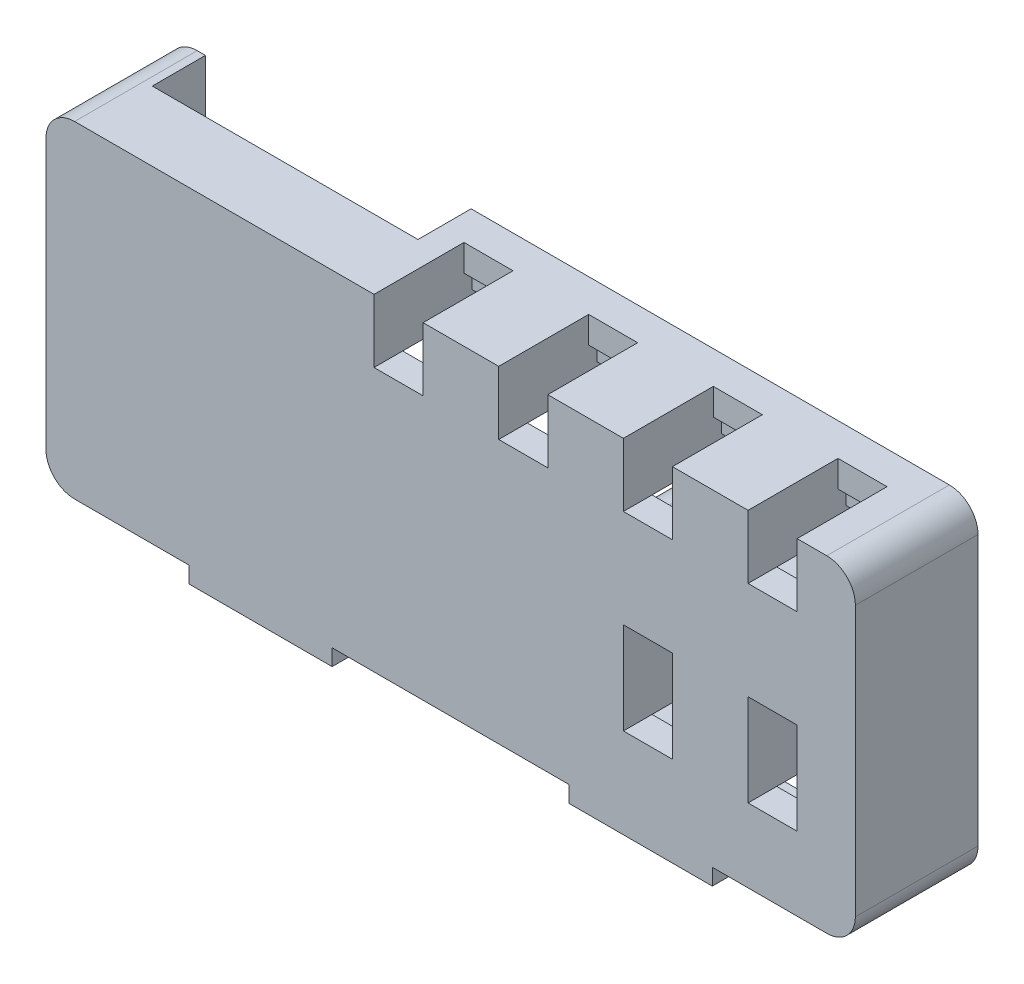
from build123d import *

# Parameters (mm, degrees)
SKETCH1_W           = 39.6
SKETCH1_H           = 16
SKETCH1_W_2         = 36.4
SKETCH1_H_2         = 11.1
BOSS_EXTRUDE1_DEPTH = 4.6
SKETCH2_W           = 12.4
SKETCH2_H           = 3.2
BOSS_EXTRUDE2_DEPTH = 4.6
SKETCH3_W           = 12.4
SKETCH3_H           = 4.2
BOSS_EXTRUDE3_DEPTH = 4.6
SKETCH4_W           = 2.4
SKETCH4_H           = 1.8
CUT_EXTRUDE1_DEPTH  = 4.6
SKETCH5_W           = 8
SKETCH5_H           = 2.4
CUT_EXTRUDE2_DEPTH  = 1.8
SKETCH6_W           = 13
SKETCH6_H           = 2.6
CUT_EXTRUDE3_DEPTH  = 3.1
SKETCH7_W           = 2.4
SKETCH7_H           = 3
CUT_EXTRUDE4_DEPTH  = 3
SKETCH8_W           = 2.4
SKETCH8_H           = 2.7
CUT_EXTRUDE5_DEPTH  = 5
FILLET2_R           = 1.6
BOSS_EXTRUDE5_REACH = 44.338
SKETCH10_W          = 7
SKETCH10_H          = 0.8
SKETCH11_W          = 0.4
SKETCH11_H          = 1.9
BOSS_EXTRUDE6_DEPTH = 4.6
SKETCH12_W          = 2.8
SKETCH12_H          = 0.8
CUT_EXTRUDE6_DEPTH  = 2.4
SKETCH14_W          = 2.4
SKETCH14_H          = 4.5
BOSS_EXTRUDE7_DEPTH = 1.4
FILLET3_R           = 1.4
SKETCH15_W          = 20.7
SKETCH15_H          = 0.9
SKETCH15_W_2        = 8.5
SKETCH15_H_2        = 3.4
BOSS_EXTRUDE8_DEPTH = 1.2


with BuildPart() as part:
    # Sketch1 → Boss-Extrude1 (new body)
    with BuildSketch(Plane.XY):
        with Locations((-19.963182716, -5.794032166)):
            Rectangle(SKETCH1_W, SKETCH1_H)
        with Locations((-19.963182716, -6.444032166)):
            Rectangle(SKETCH1_W_2, SKETCH1_H_2, mode=Mode.SUBTRACT)
    extrude(amount=BOSS_EXTRUDE1_DEPTH)

    # Sketch2 → Boss-Extrude2 (add)
    with BuildSketch(Plane.XY):
        with Locations((-7.963182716, -8.594032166)):
            Rectangle(SKETCH2_W, SKETCH2_H)
    extrude(amount=BOSS_EXTRUDE2_DEPTH)

    # Sketch3 → Boss-Extrude3 (add)
    with BuildSketch(Plane.XY):
        with Locations((-7.963182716, -4.894032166)):
            Rectangle(SKETCH3_W, SKETCH3_H)
    extrude(amount=BOSS_EXTRUDE3_DEPTH)

    # Sketch4 → Cut-Extrude1 (cut)
    with BuildSketch(Plane.XY):
        with Locations((-22.513182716, 0.005967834)):
            Rectangle(SKETCH4_W, SKETCH4_H)
        with Locations((-16.413182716, 0.005967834)):
            Rectangle(SKETCH4_W, SKETCH4_H)
        with Locations((-10.313182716, 0.005967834)):
            Rectangle(SKETCH4_W, SKETCH4_H)
        with Locations((-4.213182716, 0.005967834)):
            Rectangle(SKETCH4_W, SKETCH4_H)
        with Locations((-10.313182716, -9.294032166)):
            Rectangle(SKETCH4_W, SKETCH4_H)
        with Locations((-4.213182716, -9.294032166)):
            Rectangle(SKETCH4_W, SKETCH4_H)
    extrude(amount=CUT_EXTRUDE1_DEPTH, mode=Mode.SUBTRACT)

    # Sketch5 → Cut-Extrude2 (cut)
    with BuildSketch(Plane(origin=(0, -13.794032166, 0), x_dir=(-1, 0, 0), z_dir=(0, -1, 0))):
        with Locations((5.963182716, -1.2)):
            Rectangle(SKETCH5_W, SKETCH5_H)
    extrude(amount=-CUT_EXTRUDE2_DEPTH, mode=Mode.SUBTRACT)

    # Sketch6 → Cut-Extrude3 (cut)
    with BuildSketch(Plane(origin=(0, 2.205967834, 0), x_dir=(1, 0, 0), z_dir=(0, 1, 0))):
        with Locations((-31.463182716, -1.3)):
            Rectangle(SKETCH6_W, SKETCH6_H)
    extrude(amount=-CUT_EXTRUDE3_DEPTH, mode=Mode.SUBTRACT)

    # Sketch7 → Cut-Extrude4 (cut)
    with BuildSketch(Plane(origin=(0, 2.205967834, 0), x_dir=(1, 0, 0), z_dir=(0, 1, 0))):
        with Locations((-22.513182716, -3.1)):
            Rectangle(SKETCH7_W, SKETCH7_H)
        with Locations((-16.413182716, -3.1)):
            Rectangle(SKETCH7_W, SKETCH7_H)
        with Locations((-10.313182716, -3.1)):
            Rectangle(SKETCH7_W, SKETCH7_H)
        with Locations((-4.213182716, -3.1)):
            Rectangle(SKETCH7_W, SKETCH7_H)
    extrude(amount=-CUT_EXTRUDE4_DEPTH, mode=Mode.SUBTRACT)

    # Sketch8 → Cut-Extrude5 (cut)
    with BuildSketch(Plane.XY):
        with Locations((-10.313182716, -7.044032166)):
            Rectangle(SKETCH8_W, SKETCH8_H)
        with Locations((-4.213182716, -7.044032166)):
            Rectangle(SKETCH8_W, SKETCH8_H)
    extrude(amount=CUT_EXTRUDE5_DEPTH, mode=Mode.SUBTRACT)

    # Fillet2
    fillet2_edges = [part.edges().sort_by_distance(p)[0] for p in [
        (-14.163182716, -2.794032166, 2.3),
    ]]
    fillet(fillet2_edges, radius=FILLET2_R)

    # Boss-Extrude5: up to this face of the body (flat: up to its plane)
    boss_extrude5_end = Plane(part.part.faces().sort_by_distance((-13.736080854, -7.294032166, 4.6))[0])
    # Sketch10 → Boss-Extrude5 (add, up to the picked face)
    with BuildSketch(Plane.XY, mode=Mode.PRIVATE) as boss_extrude5_sk1:
        with Locations((-10.663182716, -14.194032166)):
            Rectangle(SKETCH10_W, SKETCH10_H)
    boss_extrude5_tool1 = split(extrude(boss_extrude5_sk1.sketch, amount=BOSS_EXTRUDE5_REACH, mode=Mode.PRIVATE), bisect_by=boss_extrude5_end, keep=Keep.BOTH, mode=Mode.PRIVATE)
    # Sketch10 → Boss-Extrude5 (add, up to the picked face)
    with BuildSketch(Plane.XY, mode=Mode.PRIVATE) as boss_extrude5_sk2:
        with Locations((-29.263182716, -14.194032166)):
            Rectangle(SKETCH10_W, SKETCH10_H)
    boss_extrude5_tool2 = split(extrude(boss_extrude5_sk2.sketch, amount=BOSS_EXTRUDE5_REACH, mode=Mode.PRIVATE), bisect_by=boss_extrude5_end, keep=Keep.BOTH, mode=Mode.PRIVATE)
    add(boss_extrude5_tool1.solids().sort_by(Axis((-10.663183, -14.194032, 0), (0, 0, 1)))[0])
    add(boss_extrude5_tool2.solids().sort_by(Axis((-29.263183, -14.194032, 0), (0, 0, 1)))[0])

    # Sketch11 → Boss-Extrude6 (add)
    with BuildSketch(Plane.XY):
        with Locations((-1.963182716, -1.844032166)):
            Rectangle(SKETCH11_W, SKETCH11_H)
    extrude(amount=BOSS_EXTRUDE6_DEPTH)

    # Sketch12 → Cut-Extrude6 (cut)
    with BuildSketch(Plane.XY):
        with Locations((-8.563182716, -14.194032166)):
            Rectangle(SKETCH12_W, SKETCH12_H)
    extrude(amount=CUT_EXTRUDE6_DEPTH, mode=Mode.SUBTRACT)

    # Sketch14 → Boss-Extrude7 (add)
    with BuildSketch(Plane.XY.offset(4.6)):
        Polygon((-39.763182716, -13.794032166), (-39.763182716, 2.205967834), (-23.713182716, 2.205967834), (-23.713182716, -0.894032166), (-21.313182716, -0.894032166), (-21.313182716, 2.205967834), (-17.613182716, 2.205967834), (-17.613182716, -0.894032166), (-15.213182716, -0.894032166), (-15.213182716, 2.205967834), (-11.513182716, 2.205967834), (-11.513182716, -0.894032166), (-9.113182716, -0.894032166), (-9.113182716, 2.205967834), (-5.413182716, 2.205967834), (-5.413182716, -0.894032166), (-3.013182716, -0.894032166), (-3.013182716, 2.205967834), (-0.163182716, 2.205967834), (-0.163182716, -13.794032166), (-7.163182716, -13.794032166), (-7.163182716, -14.594032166), (-14.163182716, -14.594032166), (-14.163182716, -13.794032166), (-25.763182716, -13.794032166), (-25.763182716, -14.594032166), (-32.763182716, -14.594032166), (-32.763182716, -13.794032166), align=None)
        with Locations((-10.313182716, -7.944032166)):
            Rectangle(SKETCH14_W, SKETCH14_H, mode=Mode.SUBTRACT)
        with Locations((-4.213182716, -7.944032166)):
            Rectangle(SKETCH14_W, SKETCH14_H, mode=Mode.SUBTRACT)
    extrude(amount=BOSS_EXTRUDE7_DEPTH)

    # Fillet3
    fillet3_edges = [part.edges().sort_by_distance(p)[0] for p in [
        (-39.763182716, 2.205967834, 3),
        (-0.163182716, 2.205967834, 3),
        (-0.163182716, -13.794032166, 3),
        (-39.763182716, -13.794032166, 3),
    ]]
    fillet(fillet3_edges, radius=FILLET3_R)

    # Sketch15 → Boss-Extrude8 (add)
    with BuildSketch(Plane.XY):
        with Locations((-13.363182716, 0.455967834)):
            Rectangle(SKETCH15_W, SKETCH15_H)
        with Locations((-7.263182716, -7.394032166)):
            Rectangle(SKETCH15_W_2, SKETCH15_H_2)
    extrude(amount=BOSS_EXTRUDE8_DEPTH)


solid = part.part
